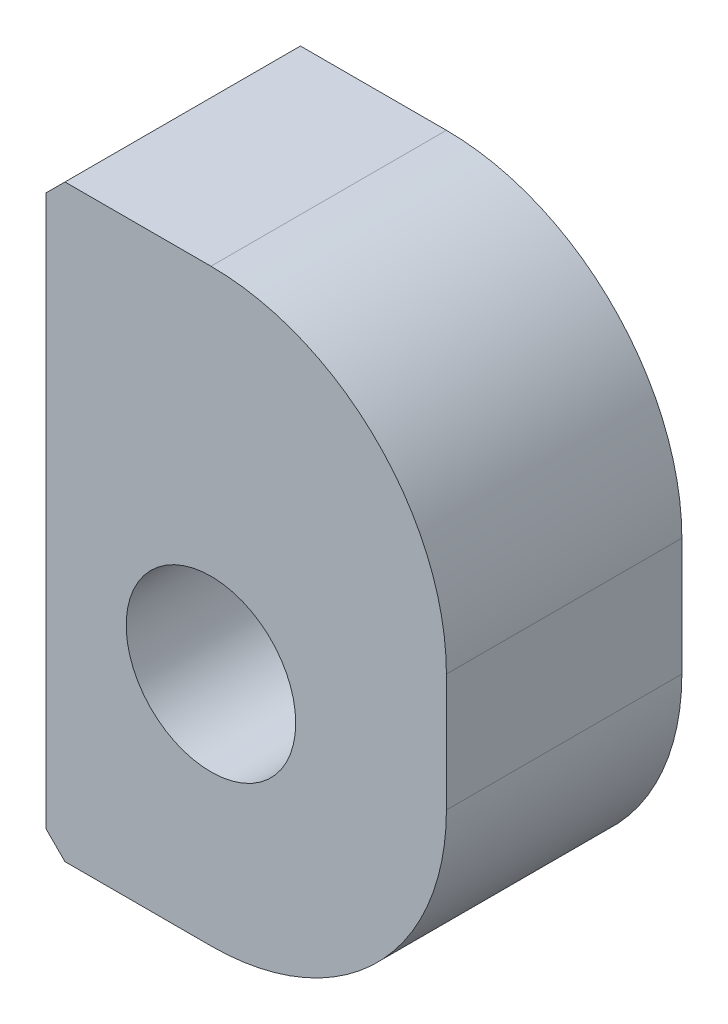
ISO-10303-21;
HEADER;
FILE_DESCRIPTION(('STEP AP214'),'2;1');
FILE_NAME('part.step','',(''),(''),'','','');
FILE_SCHEMA(('AUTOMOTIVE_DESIGN { 1 0 10303 214 1 1 1 1 }'));
ENDSEC;
DATA;
#1=APPLICATION_CONTEXT('core data for automotive mechanical design processes');
#2=APPLICATION_PROTOCOL_DEFINITION('international standard','automotive_design',2000,#1);
#3=PRODUCT_CONTEXT('',#1,'mechanical');
#4=PRODUCT('Part','Part','',(#3));
#5=PRODUCT_RELATED_PRODUCT_CATEGORY('part','',(#4));
#6=PRODUCT_DEFINITION_FORMATION('','',#4);
#7=PRODUCT_DEFINITION_CONTEXT('part definition',#1,'design');
#8=PRODUCT_DEFINITION('design','',#6,#7);
#9=PRODUCT_DEFINITION_SHAPE('','',#8);
#10=(LENGTH_UNIT() NAMED_UNIT(*) SI_UNIT(.MILLI.,.METRE.));
#11=(NAMED_UNIT(*) PLANE_ANGLE_UNIT() SI_UNIT($,.RADIAN.));
#12=(NAMED_UNIT(*) SI_UNIT($,.STERADIAN.) SOLID_ANGLE_UNIT());
#13=UNCERTAINTY_MEASURE_WITH_UNIT(LENGTH_MEASURE(1.E-05),#10,'distance_accuracy_value','');
#14=(GEOMETRIC_REPRESENTATION_CONTEXT(3) GLOBAL_UNCERTAINTY_ASSIGNED_CONTEXT((#13)) GLOBAL_UNIT_ASSIGNED_CONTEXT((#10,
#11,#12)) REPRESENTATION_CONTEXT('',''));
#15=CARTESIAN_POINT('',(0.,0.,0.));
#16=DIRECTION('',(0.,0.,1.));
#17=DIRECTION('',(1.,0.,0.));
#18=AXIS2_PLACEMENT_3D('',#15,#16,#17);
#19=CARTESIAN_POINT('',(21.5,0.,5.));
#20=DIRECTION('',(-1.,0.,0.));
#21=DIRECTION('',(0.,-1.,0.));
#22=AXIS2_PLACEMENT_3D('',#19,#20,#21);
#23=PLANE('',#22);
#24=CARTESIAN_POINT('',(21.5,-29.9040625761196,2.38124999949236));
#25=DIRECTION('',(-1.,0.,0.));
#26=DIRECTION('',(0.,-1.,0.));
#27=AXIS2_PLACEMENT_3D('',#24,#25,#26);
#28=CIRCLE('',#27,2.14999999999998);
#29=CARTESIAN_POINT('',(21.5,-32.0540625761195,2.38124999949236));
#30=VERTEX_POINT('',#29);
#31=EDGE_CURVE('E153',#30,#30,#28,.F.);
#32=ORIENTED_EDGE('',*,*,#31,.T.);
#33=EDGE_LOOP('',(#32));
#34=FACE_BOUND('',#33,.T.);
#35=DIRECTION('',(0.,1.,0.));
#36=VECTOR('',#35,1.);
#37=CARTESIAN_POINT('',(21.5,0.,5.));
#38=LINE('',#37,#36);
#39=CARTESIAN_POINT('',(21.5,-36.100000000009,5.));
#40=VERTEX_POINT('',#39);
#41=CARTESIAN_POINT('',(21.5,-24.400000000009,5.));
#42=VERTEX_POINT('',#41);
#43=EDGE_CURVE('E188',#40,#42,#38,.T.);
#44=ORIENTED_EDGE('',*,*,#43,.T.);
#45=DIRECTION('',(0.,0.,-1.));
#46=VECTOR('',#45,1.);
#47=CARTESIAN_POINT('',(21.5,-24.400000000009,0.));
#48=LINE('',#47,#46);
#49=CARTESIAN_POINT('',(21.5,-24.400000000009,0.));
#50=VERTEX_POINT('',#49);
#51=EDGE_CURVE('E158',#42,#50,#48,.T.);
#52=ORIENTED_EDGE('',*,*,#51,.T.);
#53=DIRECTION('',(0.,1.,0.));
#54=VECTOR('',#53,1.);
#55=CARTESIAN_POINT('',(21.5,0.,0.));
#56=LINE('',#55,#54);
#57=CARTESIAN_POINT('',(21.5,-36.100000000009,0.));
#58=VERTEX_POINT('',#57);
#59=EDGE_CURVE('E178',#58,#50,#56,.T.);
#60=ORIENTED_EDGE('',*,*,#59,.F.);
#61=DIRECTION('',(0.,0.,1.));
#62=VECTOR('',#61,1.);
#63=CARTESIAN_POINT('',(21.5,-36.100000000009,5.));
#64=LINE('',#63,#62);
#65=EDGE_CURVE('E156',#58,#40,#64,.T.);
#66=ORIENTED_EDGE('',*,*,#65,.T.);
#67=EDGE_LOOP('',(#44,#52,#60,#66));
#68=FACE_BOUND('',#67,.T.);
#69=ADVANCED_FACE('F43',(#34,#68),#23,.T.);
#70=CARTESIAN_POINT('',(0.,-36.500000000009,5.));
#71=DIRECTION('',(0.,-1.,0.));
#72=DIRECTION('',(0.,0.,-1.));
#73=AXIS2_PLACEMENT_3D('',#70,#71,#72);
#74=PLANE('',#73);
#75=DIRECTION('',(-1.,0.,0.));
#76=VECTOR('',#75,1.);
#77=CARTESIAN_POINT('',(0.,-36.500000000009,5.));
#78=LINE('',#77,#76);
#79=CARTESIAN_POINT('',(25.,-36.500000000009,5.));
#80=VERTEX_POINT('',#79);
#81=CARTESIAN_POINT('',(21.9,-36.500000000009,5.));
#82=VERTEX_POINT('',#81);
#83=EDGE_CURVE('E175',#80,#82,#78,.T.);
#84=ORIENTED_EDGE('',*,*,#83,.T.);
#85=DIRECTION('',(0.,0.,-1.));
#86=VECTOR('',#85,1.);
#87=CARTESIAN_POINT('',(21.9,-36.500000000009,5.));
#88=LINE('',#87,#86);
#89=CARTESIAN_POINT('',(21.9,-36.500000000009,0.));
#90=VERTEX_POINT('',#89);
#91=EDGE_CURVE('E52',#82,#90,#88,.T.);
#92=ORIENTED_EDGE('',*,*,#91,.T.);
#93=DIRECTION('',(-1.,0.,0.));
#94=VECTOR('',#93,1.);
#95=CARTESIAN_POINT('',(0.,-36.500000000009,0.));
#96=LINE('',#95,#94);
#97=CARTESIAN_POINT('',(25.,-36.500000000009,0.));
#98=VERTEX_POINT('',#97);
#99=EDGE_CURVE('E133',#98,#90,#96,.T.);
#100=ORIENTED_EDGE('',*,*,#99,.F.);
#101=DIRECTION('',(0.,0.,-1.));
#102=VECTOR('',#101,1.);
#103=CARTESIAN_POINT('',(25.,-36.500000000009,5.));
#104=LINE('',#103,#102);
#105=EDGE_CURVE('E146',#98,#80,#104,.F.);
#106=ORIENTED_EDGE('',*,*,#105,.T.);
#107=EDGE_LOOP('',(#84,#92,#100,#106));
#108=FACE_BOUND('',#107,.T.);
#109=ADVANCED_FACE('F173',(#108),#74,.T.);
#110=CARTESIAN_POINT('',(30.,0.,5.));
#111=DIRECTION('',(1.,0.,0.));
#112=DIRECTION('',(0.,1.,0.));
#113=AXIS2_PLACEMENT_3D('',#110,#111,#112);
#114=PLANE('',#113);
#115=DIRECTION('',(0.,-1.,0.));
#116=VECTOR('',#115,1.);
#117=CARTESIAN_POINT('',(30.,0.,5.));
#118=LINE('',#117,#116);
#119=CARTESIAN_POINT('',(30.,-29.000000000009,5.));
#120=VERTEX_POINT('',#119);
#121=CARTESIAN_POINT('',(30.,-31.500000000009,5.));
#122=VERTEX_POINT('',#121);
#123=EDGE_CURVE('E141',#120,#122,#118,.T.);
#124=ORIENTED_EDGE('',*,*,#123,.T.);
#125=DIRECTION('',(0.,0.,-1.));
#126=VECTOR('',#125,1.);
#127=CARTESIAN_POINT('',(30.,-31.500000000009,5.));
#128=LINE('',#127,#126);
#129=CARTESIAN_POINT('',(30.,-31.500000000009,0.));
#130=VERTEX_POINT('',#129);
#131=EDGE_CURVE('E124',#122,#130,#128,.T.);
#132=ORIENTED_EDGE('',*,*,#131,.T.);
#133=DIRECTION('',(0.,-1.,0.));
#134=VECTOR('',#133,1.);
#135=CARTESIAN_POINT('',(30.,0.,0.));
#136=LINE('',#135,#134);
#137=CARTESIAN_POINT('',(30.,-29.000000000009,0.));
#138=VERTEX_POINT('',#137);
#139=EDGE_CURVE('E117',#138,#130,#136,.T.);
#140=ORIENTED_EDGE('',*,*,#139,.F.);
#141=DIRECTION('',(0.,0.,-1.));
#142=VECTOR('',#141,1.);
#143=CARTESIAN_POINT('',(30.,-29.000000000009,5.));
#144=LINE('',#143,#142);
#145=EDGE_CURVE('E130',#138,#120,#144,.F.);
#146=ORIENTED_EDGE('',*,*,#145,.T.);
#147=EDGE_LOOP('',(#124,#132,#140,#146));
#148=FACE_BOUND('',#147,.T.);
#149=ADVANCED_FACE('F129',(#148),#114,.T.);
#150=CARTESIAN_POINT('',(25.,-31.500000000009,5.));
#151=DIRECTION('',(0.,0.,-1.));
#152=DIRECTION('',(-1.,0.,0.));
#153=AXIS2_PLACEMENT_3D('',#150,#151,#152);
#154=CYLINDRICAL_SURFACE('',#153,1.8);
#155=CARTESIAN_POINT('',(25.,-31.500000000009,5.));
#156=DIRECTION('',(0.,0.,1.));
#157=DIRECTION('',(1.,0.,0.));
#158=AXIS2_PLACEMENT_3D('',#155,#156,#157);
#159=CIRCLE('',#158,1.8);
#160=CARTESIAN_POINT('',(26.8,-31.500000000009,5.));
#161=VERTEX_POINT('',#160);
#162=EDGE_CURVE('E191',#161,#161,#159,.T.);
#163=ORIENTED_EDGE('',*,*,#162,.T.);
#164=EDGE_LOOP('',(#163));
#165=FACE_BOUND('',#164,.T.);
#166=CARTESIAN_POINT('',(25.,-31.500000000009,0.));
#167=DIRECTION('',(0.,0.,1.));
#168=DIRECTION('',(1.,0.,0.));
#169=AXIS2_PLACEMENT_3D('',#166,#167,#168);
#170=CIRCLE('',#169,1.8);
#171=CARTESIAN_POINT('',(26.8,-31.500000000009,0.));
#172=VERTEX_POINT('',#171);
#173=EDGE_CURVE('E180',#172,#172,#170,.T.);
#174=ORIENTED_EDGE('',*,*,#173,.F.);
#175=EDGE_LOOP('',(#174));
#176=FACE_BOUND('',#175,.T.);
#177=ADVANCED_FACE('F225',(#165,#176),#154,.F.);
#178=CARTESIAN_POINT('',(0.,-24.000000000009,5.));
#179=DIRECTION('',(0.,-1.,0.));
#180=DIRECTION('',(0.,0.,-1.));
#181=AXIS2_PLACEMENT_3D('',#178,#179,#180);
#182=PLANE('',#181);
#183=DIRECTION('',(-1.,0.,0.));
#184=VECTOR('',#183,1.);
#185=CARTESIAN_POINT('',(0.,-24.000000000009,0.));
#186=LINE('',#185,#184);
#187=CARTESIAN_POINT('',(25.,-24.000000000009,0.));
#188=VERTEX_POINT('',#187);
#189=CARTESIAN_POINT('',(21.9,-24.000000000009,0.));
#190=VERTEX_POINT('',#189);
#191=EDGE_CURVE('E118',#188,#190,#186,.T.);
#192=ORIENTED_EDGE('',*,*,#191,.T.);
#193=DIRECTION('',(0.,0.,1.));
#194=VECTOR('',#193,1.);
#195=CARTESIAN_POINT('',(21.9,-24.000000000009,5.));
#196=LINE('',#195,#194);
#197=CARTESIAN_POINT('',(21.9,-24.000000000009,5.));
#198=VERTEX_POINT('',#197);
#199=EDGE_CURVE('E67',#190,#198,#196,.T.);
#200=ORIENTED_EDGE('',*,*,#199,.T.);
#201=DIRECTION('',(-1.,0.,0.));
#202=VECTOR('',#201,1.);
#203=CARTESIAN_POINT('',(0.,-24.000000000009,5.));
#204=LINE('',#203,#202);
#205=CARTESIAN_POINT('',(25.,-24.000000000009,5.));
#206=VERTEX_POINT('',#205);
#207=EDGE_CURVE('E138',#206,#198,#204,.T.);
#208=ORIENTED_EDGE('',*,*,#207,.F.);
#209=DIRECTION('',(0.,0.,-1.));
#210=VECTOR('',#209,1.);
#211=CARTESIAN_POINT('',(25.,-24.000000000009,0.));
#212=LINE('',#211,#210);
#213=EDGE_CURVE('E151',#206,#188,#212,.T.);
#214=ORIENTED_EDGE('',*,*,#213,.T.);
#215=EDGE_LOOP('',(#192,#200,#208,#214));
#216=FACE_BOUND('',#215,.T.);
#217=ADVANCED_FACE('F228',(#216),#182,.F.);
#218=CARTESIAN_POINT('',(0.,0.,5.));
#219=DIRECTION('',(0.,0.,1.));
#220=DIRECTION('',(1.,0.,0.));
#221=AXIS2_PLACEMENT_3D('',#218,#219,#220);
#222=PLANE('',#221);
#223=ORIENTED_EDGE('',*,*,#162,.F.);
#224=EDGE_LOOP('',(#223));
#225=FACE_BOUND('',#224,.T.);
#226=ORIENTED_EDGE('',*,*,#207,.T.);
#227=DIRECTION('',(-0.707106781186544,-0.707106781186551,0.));
#228=VECTOR('',#227,1.);
#229=CARTESIAN_POINT('',(22.9500000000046,-22.9500000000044,5.));
#230=LINE('',#229,#228);
#231=EDGE_CURVE('E167',#198,#42,#230,.T.);
#232=ORIENTED_EDGE('',*,*,#231,.T.);
#233=ORIENTED_EDGE('',*,*,#43,.F.);
#234=DIRECTION('',(-0.707106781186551,0.707106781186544,0.));
#235=VECTOR('',#234,1.);
#236=CARTESIAN_POINT('',(-7.30000000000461,-7.30000000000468,5.));
#237=LINE('',#236,#235);
#238=EDGE_CURVE('E59',#40,#82,#237,.F.);
#239=ORIENTED_EDGE('',*,*,#238,.T.);
#240=ORIENTED_EDGE('',*,*,#83,.F.);
#241=CARTESIAN_POINT('',(25.,-31.500000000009,5.));
#242=DIRECTION('',(0.,0.,1.));
#243=DIRECTION('',(1.,0.,0.));
#244=AXIS2_PLACEMENT_3D('',#241,#242,#243);
#245=CIRCLE('',#244,5.);
#246=EDGE_CURVE('E149',#80,#122,#245,.T.);
#247=ORIENTED_EDGE('',*,*,#246,.T.);
#248=ORIENTED_EDGE('',*,*,#123,.F.);
#249=CARTESIAN_POINT('',(25.,-29.000000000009,5.));
#250=DIRECTION('',(0.,0.,1.));
#251=DIRECTION('',(1.,0.,0.));
#252=AXIS2_PLACEMENT_3D('',#249,#250,#251);
#253=CIRCLE('',#252,5.);
#254=EDGE_CURVE('E137',#120,#206,#253,.T.);
#255=ORIENTED_EDGE('',*,*,#254,.T.);
#256=EDGE_LOOP('',(#226,#232,#233,#239,#240,#247,#248,#255));
#257=FACE_BOUND('',#256,.T.);
#258=ADVANCED_FACE('F210',(#225,#257),#222,.T.);
#259=CARTESIAN_POINT('',(0.,0.,0.));
#260=DIRECTION('',(0.,0.,1.));
#261=DIRECTION('',(1.,0.,0.));
#262=AXIS2_PLACEMENT_3D('',#259,#260,#261);
#263=PLANE('',#262);
#264=ORIENTED_EDGE('',*,*,#173,.T.);
#265=EDGE_LOOP('',(#264));
#266=FACE_BOUND('',#265,.T.);
#267=ORIENTED_EDGE('',*,*,#59,.T.);
#268=DIRECTION('',(0.707106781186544,0.707106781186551,0.));
#269=VECTOR('',#268,1.);
#270=CARTESIAN_POINT('',(21.5,-24.400000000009,0.));
#271=LINE('',#270,#269);
#272=EDGE_CURVE('E163',#50,#190,#271,.T.);
#273=ORIENTED_EDGE('',*,*,#272,.T.);
#274=ORIENTED_EDGE('',*,*,#191,.F.);
#275=CARTESIAN_POINT('',(25.,-29.000000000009,0.));
#276=DIRECTION('',(0.,0.,1.));
#277=DIRECTION('',(1.,0.,0.));
#278=AXIS2_PLACEMENT_3D('',#275,#276,#277);
#279=CIRCLE('',#278,5.);
#280=EDGE_CURVE('E113',#188,#138,#279,.F.);
#281=ORIENTED_EDGE('',*,*,#280,.T.);
#282=ORIENTED_EDGE('',*,*,#139,.T.);
#283=CARTESIAN_POINT('',(25.,-31.500000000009,0.));
#284=DIRECTION('',(0.,0.,1.));
#285=DIRECTION('',(1.,0.,0.));
#286=AXIS2_PLACEMENT_3D('',#283,#284,#285);
#287=CIRCLE('',#286,5.);
#288=EDGE_CURVE('E123',#130,#98,#287,.F.);
#289=ORIENTED_EDGE('',*,*,#288,.T.);
#290=ORIENTED_EDGE('',*,*,#99,.T.);
#291=DIRECTION('',(0.707106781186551,-0.707106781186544,0.));
#292=VECTOR('',#291,1.);
#293=CARTESIAN_POINT('',(21.9,-36.500000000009,0.));
#294=LINE('',#293,#292);
#295=EDGE_CURVE('E161',#90,#58,#294,.F.);
#296=ORIENTED_EDGE('',*,*,#295,.T.);
#297=EDGE_LOOP('',(#267,#273,#274,#281,#282,#289,#290,#296));
#298=FACE_BOUND('',#297,.T.);
#299=ADVANCED_FACE('F116',(#266,#298),#263,.F.);
#300=CARTESIAN_POINT('',(22.5,-29.9040625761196,2.38124999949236));
#301=DIRECTION('',(-1.,0.,0.));
#302=DIRECTION('',(0.,0.,1.));
#303=AXIS2_PLACEMENT_3D('',#300,#301,#302);
#304=CYLINDRICAL_SURFACE('',#303,1.74999999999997);
#305=CARTESIAN_POINT('',(21.9,-29.9040625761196,2.38124999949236));
#306=DIRECTION('',(-1.,0.,0.));
#307=DIRECTION('',(0.,0.,1.));
#308=AXIS2_PLACEMENT_3D('',#305,#306,#307);
#309=CIRCLE('',#308,1.74999999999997);
#310=CARTESIAN_POINT('',(21.9,-29.9040625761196,4.13124999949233));
#311=VERTEX_POINT('',#310);
#312=EDGE_CURVE('E11',#311,#311,#309,.T.);
#313=ORIENTED_EDGE('',*,*,#312,.T.);
#314=EDGE_LOOP('',(#313));
#315=FACE_BOUND('',#314,.T.);
#316=CARTESIAN_POINT('',(22.5,-29.9040625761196,2.38124999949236));
#317=DIRECTION('',(-1.,0.,0.));
#318=DIRECTION('',(0.,0.,1.));
#319=AXIS2_PLACEMENT_3D('',#316,#317,#318);
#320=CIRCLE('',#319,1.74999999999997);
#321=CARTESIAN_POINT('',(22.5,-29.9040625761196,4.13124999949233));
#322=VERTEX_POINT('',#321);
#323=EDGE_CURVE('E184',#322,#322,#320,.T.);
#324=ORIENTED_EDGE('',*,*,#323,.F.);
#325=EDGE_LOOP('',(#324));
#326=FACE_BOUND('',#325,.T.);
#327=ADVANCED_FACE('F199',(#315,#326),#304,.F.);
#328=CARTESIAN_POINT('',(22.5,-29.9040625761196,2.38124999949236));
#329=DIRECTION('',(-1.,0.,0.));
#330=DIRECTION('',(0.,0.,1.));
#331=AXIS2_PLACEMENT_3D('',#328,#329,#330);
#332=PLANE('',#331);
#333=ORIENTED_EDGE('',*,*,#323,.T.);
#334=EDGE_LOOP('',(#333));
#335=FACE_BOUND('',#334,.T.);
#336=ADVANCED_FACE('F197',(#335),#332,.T.);
#337=CARTESIAN_POINT('',(25.,-31.500000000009,5.));
#338=DIRECTION('',(0.,0.,-1.));
#339=DIRECTION('',(-1.,0.,0.));
#340=AXIS2_PLACEMENT_3D('',#337,#338,#339);
#341=CYLINDRICAL_SURFACE('',#340,5.);
#342=ORIENTED_EDGE('',*,*,#246,.F.);
#343=ORIENTED_EDGE('',*,*,#105,.F.);
#344=ORIENTED_EDGE('',*,*,#288,.F.);
#345=ORIENTED_EDGE('',*,*,#131,.F.);
#346=EDGE_LOOP('',(#342,#343,#344,#345));
#347=FACE_BOUND('',#346,.T.);
#348=ADVANCED_FACE('F208',(#347),#341,.T.);
#349=CARTESIAN_POINT('',(25.,-29.000000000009,5.));
#350=DIRECTION('',(0.,0.,1.));
#351=DIRECTION('',(1.,0.,0.));
#352=AXIS2_PLACEMENT_3D('',#349,#350,#351);
#353=CYLINDRICAL_SURFACE('',#352,5.);
#354=ORIENTED_EDGE('',*,*,#254,.F.);
#355=ORIENTED_EDGE('',*,*,#145,.F.);
#356=ORIENTED_EDGE('',*,*,#280,.F.);
#357=ORIENTED_EDGE('',*,*,#213,.F.);
#358=EDGE_LOOP('',(#354,#355,#356,#357));
#359=FACE_BOUND('',#358,.T.);
#360=ADVANCED_FACE('F136',(#359),#353,.T.);
#361=CARTESIAN_POINT('',(21.5,-24.400000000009,5.));
#362=DIRECTION('',(-0.707106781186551,0.707106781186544,0.));
#363=DIRECTION('',(0.,0.,1.));
#364=AXIS2_PLACEMENT_3D('',#361,#362,#363);
#365=PLANE('',#364);
#366=ORIENTED_EDGE('',*,*,#231,.F.);
#367=ORIENTED_EDGE('',*,*,#199,.F.);
#368=ORIENTED_EDGE('',*,*,#272,.F.);
#369=ORIENTED_EDGE('',*,*,#51,.F.);
#370=EDGE_LOOP('',(#366,#367,#368,#369));
#371=FACE_BOUND('',#370,.T.);
#372=ADVANCED_FACE('F234',(#371),#365,.T.);
#373=CARTESIAN_POINT('',(21.9,-36.500000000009,5.));
#374=DIRECTION('',(0.707106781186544,0.707106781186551,0.));
#375=DIRECTION('',(0.,0.,-1.));
#376=AXIS2_PLACEMENT_3D('',#373,#374,#375);
#377=PLANE('',#376);
#378=ORIENTED_EDGE('',*,*,#238,.F.);
#379=ORIENTED_EDGE('',*,*,#65,.F.);
#380=ORIENTED_EDGE('',*,*,#295,.F.);
#381=ORIENTED_EDGE('',*,*,#91,.F.);
#382=EDGE_LOOP('',(#378,#379,#380,#381));
#383=FACE_BOUND('',#382,.T.);
#384=ADVANCED_FACE('F239',(#383),#377,.F.);
#385=CARTESIAN_POINT('',(21.9,-29.9040625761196,2.38124999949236));
#386=DIRECTION('',(-1.,0.,0.));
#387=DIRECTION('',(0.,0.,1.));
#388=AXIS2_PLACEMENT_3D('',#385,#386,#387);
#389=CONICAL_SURFACE('',#388,1.74999999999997,0.785398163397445);
#390=ORIENTED_EDGE('',*,*,#31,.F.);
#391=EDGE_LOOP('',(#390));
#392=FACE_BOUND('',#391,.T.);
#393=ORIENTED_EDGE('',*,*,#312,.F.);
#394=EDGE_LOOP('',(#393));
#395=FACE_BOUND('',#394,.T.);
#396=ADVANCED_FACE('F46',(#392,#395),#389,.F.);
#397=CLOSED_SHELL('',(#69,#109,#149,#177,#217,#258,#299,#327,#336,#348,#360,#372,#384,#396));
#398=MANIFOLD_SOLID_BREP('B2',#397);
#399=ADVANCED_BREP_SHAPE_REPRESENTATION('',(#18,#398),#14);
#400=SHAPE_DEFINITION_REPRESENTATION(#9,#399);
ENDSEC;
END-ISO-10303-21;
